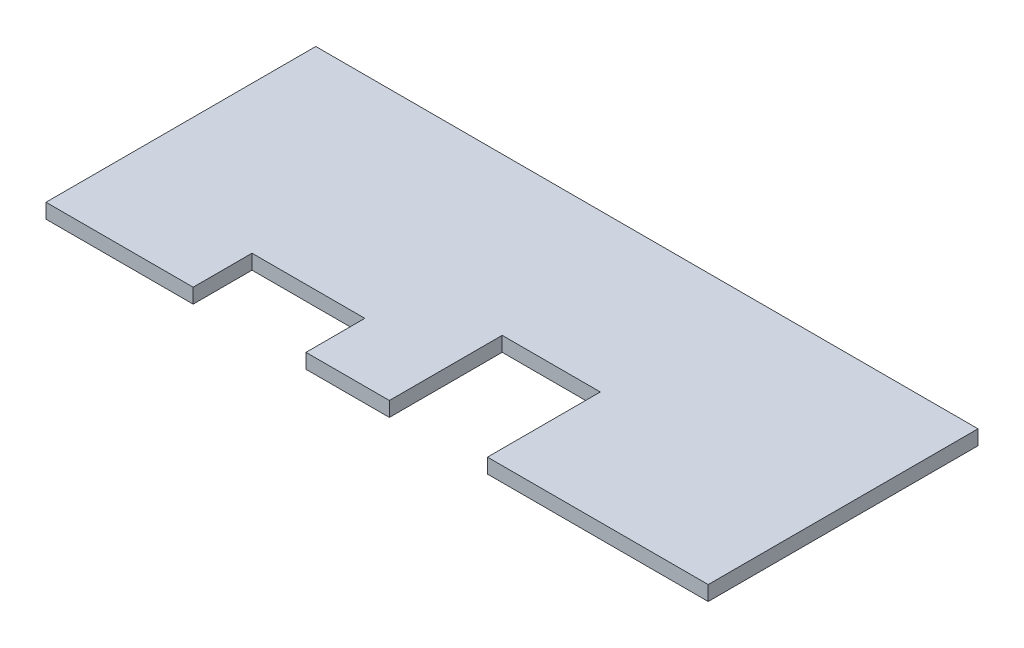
from build123d import *

# Parameters (mm, degrees)
SKETCH1_W           = 30
SKETCH1_H           = 12
BOSS_EXTRUDE1_DEPTH = 3


with BuildPart() as part:
    # Sketch1 → Boss-Extrude1 (new body)
    with BuildSketch(Plane(origin=(0, 0, 0), x_dir=(1, 0, 0), z_dir=(0, 1, 0))):
        with Locations((-52.5, -21.5)):
            Rectangle(SKETCH1_W, SKETCH1_H)
        Polygon((-67.5, 27.5), (-67.5, -15.5), (-37.5, -15.5), (-14.5, -15.5), (-14.5, -27.5), (2.5, -27.5), (2.5, -4.5), (22.5, -4.5), (22.5, -27.5), (67.5, -27.5), (67.5, 27.5), align=None)
    extrude(amount=BOSS_EXTRUDE1_DEPTH)


solid = part.part
